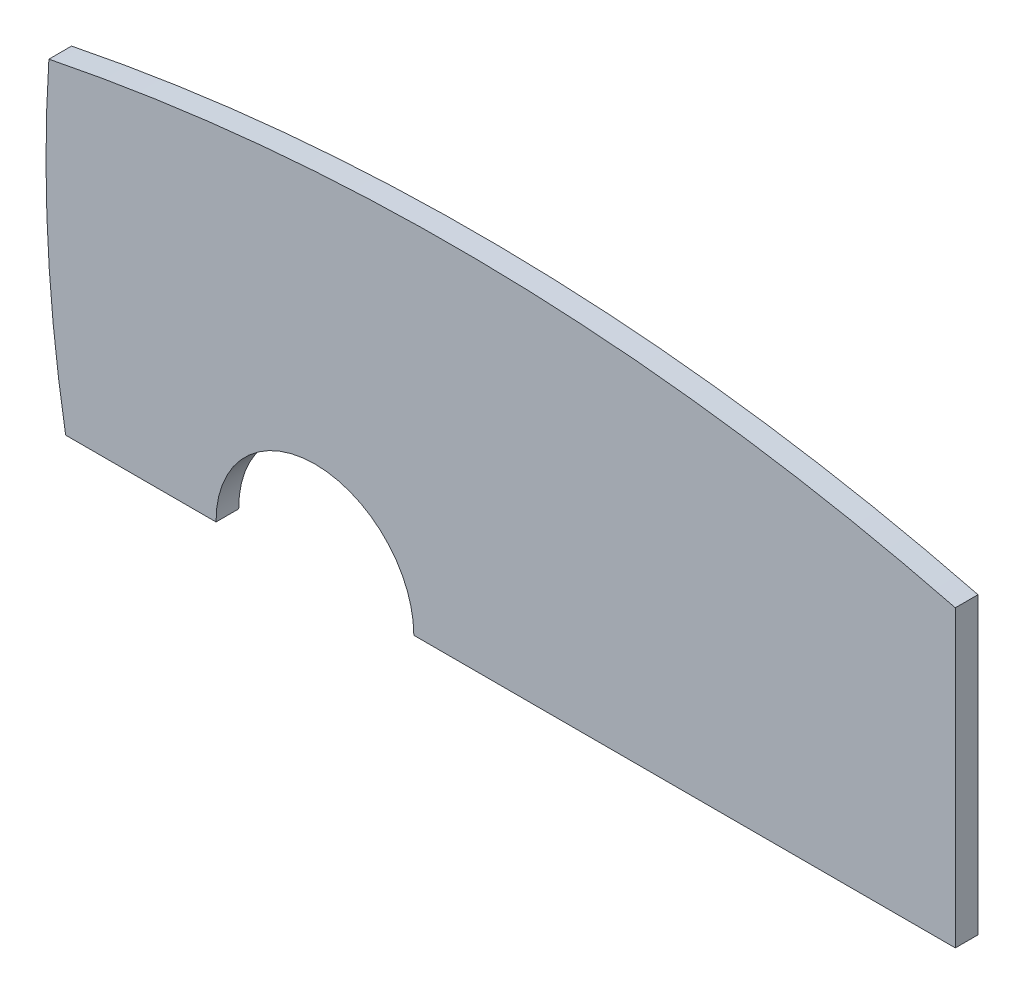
ISO-10303-21;
HEADER;
FILE_DESCRIPTION(('STEP AP214'),'2;1');
FILE_NAME('part.step','',(''),(''),'','','');
FILE_SCHEMA(('AUTOMOTIVE_DESIGN { 1 0 10303 214 1 1 1 1 }'));
ENDSEC;
DATA;
#1=APPLICATION_CONTEXT('core data for automotive mechanical design processes');
#2=APPLICATION_PROTOCOL_DEFINITION('international standard','automotive_design',2000,#1);
#3=PRODUCT_CONTEXT('',#1,'mechanical');
#4=PRODUCT('Part','Part','',(#3));
#5=PRODUCT_RELATED_PRODUCT_CATEGORY('part','',(#4));
#6=PRODUCT_DEFINITION_FORMATION('','',#4);
#7=PRODUCT_DEFINITION_CONTEXT('part definition',#1,'design');
#8=PRODUCT_DEFINITION('design','',#6,#7);
#9=PRODUCT_DEFINITION_SHAPE('','',#8);
#10=(LENGTH_UNIT() NAMED_UNIT(*) SI_UNIT(.MILLI.,.METRE.));
#11=(NAMED_UNIT(*) PLANE_ANGLE_UNIT() SI_UNIT($,.RADIAN.));
#12=(NAMED_UNIT(*) SI_UNIT($,.STERADIAN.) SOLID_ANGLE_UNIT());
#13=UNCERTAINTY_MEASURE_WITH_UNIT(LENGTH_MEASURE(1.E-05),#10,'distance_accuracy_value','');
#14=(GEOMETRIC_REPRESENTATION_CONTEXT(3) GLOBAL_UNCERTAINTY_ASSIGNED_CONTEXT((#13)) GLOBAL_UNIT_ASSIGNED_CONTEXT((#10,
#11,#12)) REPRESENTATION_CONTEXT('',''));
#15=CARTESIAN_POINT('',(0.,0.,0.));
#16=DIRECTION('',(0.,0.,1.));
#17=DIRECTION('',(1.,0.,0.));
#18=AXIS2_PLACEMENT_3D('',#15,#16,#17);
#19=CARTESIAN_POINT('',(-110.597503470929,-436.19742345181,5.));
#20=DIRECTION('',(0.,0.,-1.));
#21=DIRECTION('',(-1.,0.,0.));
#22=AXIS2_PLACEMENT_3D('',#19,#20,#21);
#23=CYLINDRICAL_SURFACE('',#22,450.);
#24=CARTESIAN_POINT('',(-110.597503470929,-436.19742345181,0.));
#25=DIRECTION('',(0.,0.,1.));
#26=DIRECTION('',(1.,0.,0.));
#27=AXIS2_PLACEMENT_3D('',#24,#25,#26);
#28=CIRCLE('',#27,450.);
#29=CARTESIAN_POINT('',(0.,0.,0.));
#30=VERTEX_POINT('',#29);
#31=CARTESIAN_POINT('',(-200.,4.83227352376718,0.));
#32=VERTEX_POINT('',#31);
#33=EDGE_CURVE('E114',#30,#32,#28,.T.);
#34=ORIENTED_EDGE('',*,*,#33,.T.);
#35=DIRECTION('',(0.,0.,-1.));
#36=VECTOR('',#35,1.);
#37=CARTESIAN_POINT('',(-200.,4.83227352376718,5.));
#38=LINE('',#37,#36);
#39=CARTESIAN_POINT('',(-200.,4.83227352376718,5.));
#40=VERTEX_POINT('',#39);
#41=EDGE_CURVE('E11',#40,#32,#38,.T.);
#42=ORIENTED_EDGE('',*,*,#41,.F.);
#43=CARTESIAN_POINT('',(-110.597503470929,-436.19742345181,5.));
#44=DIRECTION('',(0.,0.,1.));
#45=DIRECTION('',(1.,0.,0.));
#46=AXIS2_PLACEMENT_3D('',#43,#44,#45);
#47=CIRCLE('',#46,450.);
#48=CARTESIAN_POINT('',(0.,0.,5.));
#49=VERTEX_POINT('',#48);
#50=EDGE_CURVE('E124',#49,#40,#47,.T.);
#51=ORIENTED_EDGE('',*,*,#50,.F.);
#52=DIRECTION('',(0.,0.,-1.));
#53=VECTOR('',#52,1.);
#54=CARTESIAN_POINT('',(0.,0.,5.));
#55=LINE('',#54,#53);
#56=EDGE_CURVE('E110',#49,#30,#55,.T.);
#57=ORIENTED_EDGE('',*,*,#56,.T.);
#58=EDGE_LOOP('',(#34,#42,#51,#57));
#59=FACE_BOUND('',#58,.T.);
#60=ADVANCED_FACE('F30',(#59),#23,.T.);
#61=CARTESIAN_POINT('',(96.5790281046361,-14.6109725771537,5.));
#62=DIRECTION('',(0.,0.,-1.));
#63=DIRECTION('',(-1.,0.,0.));
#64=AXIS2_PLACEMENT_3D('',#61,#62,#63);
#65=CYLINDRICAL_SURFACE('',#64,297.215678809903);
#66=CARTESIAN_POINT('',(96.5790281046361,-14.6109725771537,0.));
#67=DIRECTION('',(0.,0.,1.));
#68=DIRECTION('',(1.,0.,0.));
#69=AXIS2_PLACEMENT_3D('',#66,#67,#68);
#70=CIRCLE('',#69,297.215678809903);
#71=CARTESIAN_POINT('',(-196.305205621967,-65.1677264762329,0.));
#72=VERTEX_POINT('',#71);
#73=EDGE_CURVE('E117',#32,#72,#70,.T.);
#74=ORIENTED_EDGE('',*,*,#73,.T.);
#75=DIRECTION('',(0.,0.,-1.));
#76=VECTOR('',#75,1.);
#77=CARTESIAN_POINT('',(-196.305205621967,-65.1677264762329,5.));
#78=LINE('',#77,#76);
#79=CARTESIAN_POINT('',(-196.305205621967,-65.1677264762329,5.));
#80=VERTEX_POINT('',#79);
#81=EDGE_CURVE('E38',#80,#72,#78,.T.);
#82=ORIENTED_EDGE('',*,*,#81,.F.);
#83=CARTESIAN_POINT('',(96.5790281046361,-14.6109725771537,5.));
#84=DIRECTION('',(0.,0.,1.));
#85=DIRECTION('',(1.,0.,0.));
#86=AXIS2_PLACEMENT_3D('',#83,#84,#85);
#87=CIRCLE('',#86,297.215678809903);
#88=EDGE_CURVE('E83',#40,#80,#87,.T.);
#89=ORIENTED_EDGE('',*,*,#88,.F.);
#90=ORIENTED_EDGE('',*,*,#41,.T.);
#91=EDGE_LOOP('',(#74,#82,#89,#90));
#92=FACE_BOUND('',#91,.T.);
#93=ADVANCED_FACE('F148',(#92),#65,.T.);
#94=CARTESIAN_POINT('',(-196.305205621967,-65.1677264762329,5.));
#95=DIRECTION('',(0.,1.,0.));
#96=DIRECTION('',(0.,0.,1.));
#97=AXIS2_PLACEMENT_3D('',#94,#95,#96);
#98=PLANE('',#97);
#99=DIRECTION('',(1.,0.,0.));
#100=VECTOR('',#99,1.);
#101=CARTESIAN_POINT('',(-196.305205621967,-65.1677264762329,0.));
#102=LINE('',#101,#100);
#103=CARTESIAN_POINT('',(-163.115239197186,-65.1677264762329,0.));
#104=VERTEX_POINT('',#103);
#105=EDGE_CURVE('E119',#72,#104,#102,.T.);
#106=ORIENTED_EDGE('',*,*,#105,.T.);
#107=DIRECTION('',(0.,0.,-1.));
#108=VECTOR('',#107,1.);
#109=CARTESIAN_POINT('',(-163.115239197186,-65.1677264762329,5.));
#110=LINE('',#109,#108);
#111=CARTESIAN_POINT('',(-163.115239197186,-65.1677264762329,5.));
#112=VERTEX_POINT('',#111);
#113=EDGE_CURVE('E105',#112,#104,#110,.T.);
#114=ORIENTED_EDGE('',*,*,#113,.F.);
#115=DIRECTION('',(1.,0.,0.));
#116=VECTOR('',#115,1.);
#117=CARTESIAN_POINT('',(-196.305205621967,-65.1677264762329,5.));
#118=LINE('',#117,#116);
#119=EDGE_CURVE('E96',#80,#112,#118,.T.);
#120=ORIENTED_EDGE('',*,*,#119,.F.);
#121=ORIENTED_EDGE('',*,*,#81,.T.);
#122=EDGE_LOOP('',(#106,#114,#120,#121));
#123=FACE_BOUND('',#122,.T.);
#124=ADVANCED_FACE('F130',(#123),#98,.F.);
#125=CARTESIAN_POINT('',(-141.296977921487,-65.,5.));
#126=DIRECTION('',(0.,0.,-1.));
#127=DIRECTION('',(-1.,0.,0.));
#128=AXIS2_PLACEMENT_3D('',#125,#126,#127);
#129=CYLINDRICAL_SURFACE('',#128,21.8189059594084);
#130=CARTESIAN_POINT('',(-141.296977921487,-65.,0.));
#131=DIRECTION('',(0.,0.,-1.));
#132=DIRECTION('',(-1.,0.,0.));
#133=AXIS2_PLACEMENT_3D('',#130,#131,#132);
#134=CIRCLE('',#133,21.8189059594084);
#135=CARTESIAN_POINT('',(-119.478071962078,-65.,0.));
#136=VERTEX_POINT('',#135);
#137=EDGE_CURVE('E104',#104,#136,#134,.T.);
#138=ORIENTED_EDGE('',*,*,#137,.T.);
#139=DIRECTION('',(0.,0.,-1.));
#140=VECTOR('',#139,1.);
#141=CARTESIAN_POINT('',(-119.478071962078,-65.,5.));
#142=LINE('',#141,#140);
#143=CARTESIAN_POINT('',(-119.478071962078,-65.,5.));
#144=VERTEX_POINT('',#143);
#145=EDGE_CURVE('E101',#144,#136,#142,.T.);
#146=ORIENTED_EDGE('',*,*,#145,.F.);
#147=CARTESIAN_POINT('',(-141.296977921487,-65.,5.));
#148=DIRECTION('',(0.,0.,-1.));
#149=DIRECTION('',(-1.,0.,0.));
#150=AXIS2_PLACEMENT_3D('',#147,#148,#149);
#151=CIRCLE('',#150,21.8189059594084);
#152=EDGE_CURVE('E90',#112,#144,#151,.T.);
#153=ORIENTED_EDGE('',*,*,#152,.F.);
#154=ORIENTED_EDGE('',*,*,#113,.T.);
#155=EDGE_LOOP('',(#138,#146,#153,#154));
#156=FACE_BOUND('',#155,.T.);
#157=ADVANCED_FACE('F102',(#156),#129,.F.);
#158=CARTESIAN_POINT('',(-119.478071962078,-65.,5.));
#159=DIRECTION('',(0.,1.,0.));
#160=DIRECTION('',(0.,0.,1.));
#161=AXIS2_PLACEMENT_3D('',#158,#159,#160);
#162=PLANE('',#161);
#163=DIRECTION('',(1.,0.,0.));
#164=VECTOR('',#163,1.);
#165=CARTESIAN_POINT('',(-119.478071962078,-65.,0.));
#166=LINE('',#165,#164);
#167=CARTESIAN_POINT('',(0.,-65.,0.));
#168=VERTEX_POINT('',#167);
#169=EDGE_CURVE('E69',#136,#168,#166,.T.);
#170=ORIENTED_EDGE('',*,*,#169,.T.);
#171=DIRECTION('',(0.,0.,-1.));
#172=VECTOR('',#171,1.);
#173=CARTESIAN_POINT('',(0.,-65.,5.));
#174=LINE('',#173,#172);
#175=CARTESIAN_POINT('',(0.,-65.,5.));
#176=VERTEX_POINT('',#175);
#177=EDGE_CURVE('E106',#176,#168,#174,.T.);
#178=ORIENTED_EDGE('',*,*,#177,.F.);
#179=DIRECTION('',(1.,0.,0.));
#180=VECTOR('',#179,1.);
#181=CARTESIAN_POINT('',(-119.478071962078,-65.,5.));
#182=LINE('',#181,#180);
#183=EDGE_CURVE('E94',#144,#176,#182,.T.);
#184=ORIENTED_EDGE('',*,*,#183,.F.);
#185=ORIENTED_EDGE('',*,*,#145,.T.);
#186=EDGE_LOOP('',(#170,#178,#184,#185));
#187=FACE_BOUND('',#186,.T.);
#188=ADVANCED_FACE('F108',(#187),#162,.F.);
#189=CARTESIAN_POINT('',(0.,-65.,5.));
#190=DIRECTION('',(-1.,0.,0.));
#191=DIRECTION('',(0.,0.,1.));
#192=AXIS2_PLACEMENT_3D('',#189,#190,#191);
#193=PLANE('',#192);
#194=DIRECTION('',(0.,1.,0.));
#195=VECTOR('',#194,1.);
#196=CARTESIAN_POINT('',(0.,-65.,0.));
#197=LINE('',#196,#195);
#198=EDGE_CURVE('E75',#168,#30,#197,.T.);
#199=ORIENTED_EDGE('',*,*,#198,.T.);
#200=ORIENTED_EDGE('',*,*,#56,.F.);
#201=DIRECTION('',(0.,1.,0.));
#202=VECTOR('',#201,1.);
#203=CARTESIAN_POINT('',(0.,-65.,5.));
#204=LINE('',#203,#202);
#205=EDGE_CURVE('E46',#176,#49,#204,.T.);
#206=ORIENTED_EDGE('',*,*,#205,.F.);
#207=ORIENTED_EDGE('',*,*,#177,.T.);
#208=EDGE_LOOP('',(#199,#200,#206,#207));
#209=FACE_BOUND('',#208,.T.);
#210=ADVANCED_FACE('F137',(#209),#193,.F.);
#211=CARTESIAN_POINT('',(-110.597503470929,-436.19742345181,5.));
#212=DIRECTION('',(0.,0.,1.));
#213=DIRECTION('',(1.,0.,0.));
#214=AXIS2_PLACEMENT_3D('',#211,#212,#213);
#215=PLANE('',#214);
#216=ORIENTED_EDGE('',*,*,#50,.T.);
#217=ORIENTED_EDGE('',*,*,#88,.T.);
#218=ORIENTED_EDGE('',*,*,#119,.T.);
#219=ORIENTED_EDGE('',*,*,#152,.T.);
#220=ORIENTED_EDGE('',*,*,#183,.T.);
#221=ORIENTED_EDGE('',*,*,#205,.T.);
#222=EDGE_LOOP('',(#216,#217,#218,#219,#220,#221));
#223=FACE_BOUND('',#222,.T.);
#224=ADVANCED_FACE('F92',(#223),#215,.T.);
#225=CARTESIAN_POINT('',(-110.597503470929,-436.19742345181,0.));
#226=DIRECTION('',(0.,0.,1.));
#227=DIRECTION('',(1.,0.,0.));
#228=AXIS2_PLACEMENT_3D('',#225,#226,#227);
#229=PLANE('',#228);
#230=ORIENTED_EDGE('',*,*,#33,.F.);
#231=ORIENTED_EDGE('',*,*,#198,.F.);
#232=ORIENTED_EDGE('',*,*,#169,.F.);
#233=ORIENTED_EDGE('',*,*,#137,.F.);
#234=ORIENTED_EDGE('',*,*,#105,.F.);
#235=ORIENTED_EDGE('',*,*,#73,.F.);
#236=EDGE_LOOP('',(#230,#231,#232,#233,#234,#235));
#237=FACE_BOUND('',#236,.T.);
#238=ADVANCED_FACE('F133',(#237),#229,.F.);
#239=CLOSED_SHELL('',(#60,#93,#124,#157,#188,#210,#224,#238));
#240=MANIFOLD_SOLID_BREP('B2',#239);
#241=ADVANCED_BREP_SHAPE_REPRESENTATION('',(#18,#240),#14);
#242=SHAPE_DEFINITION_REPRESENTATION(#9,#241);
ENDSEC;
END-ISO-10303-21;
